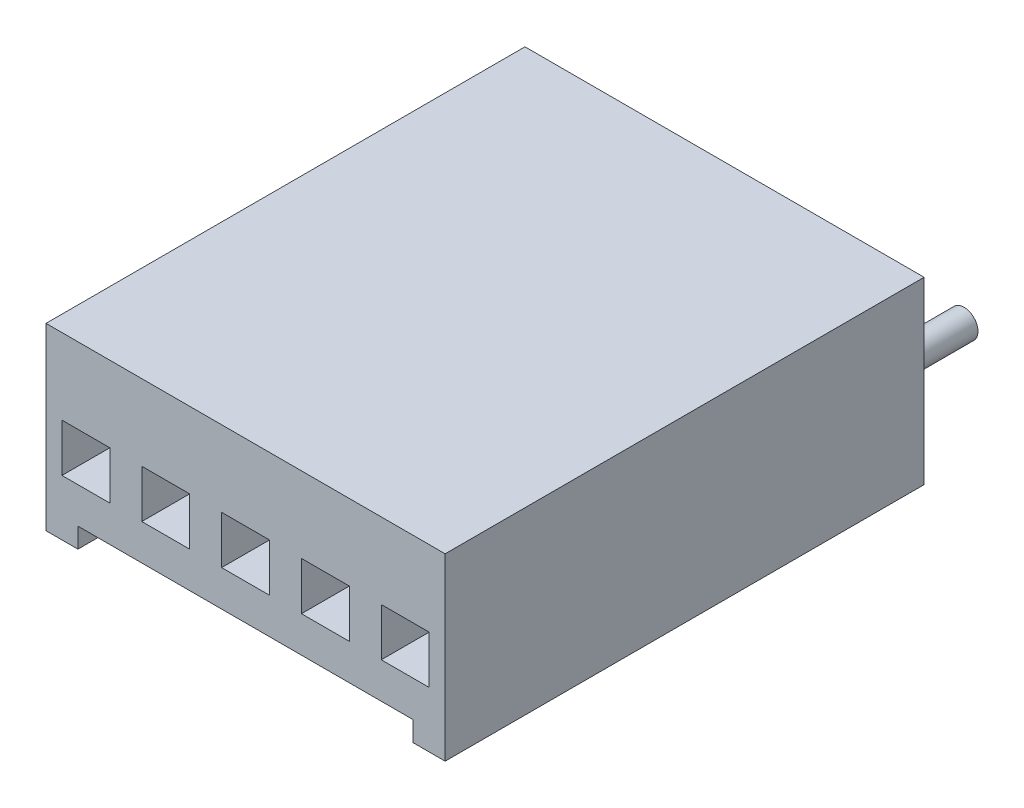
ISO-10303-21;
HEADER;
FILE_DESCRIPTION(('STEP AP214'),'2;1');
FILE_NAME('part.step','',(''),(''),'','','');
FILE_SCHEMA(('AUTOMOTIVE_DESIGN { 1 0 10303 214 1 1 1 1 }'));
ENDSEC;
DATA;
#1=APPLICATION_CONTEXT('core data for automotive mechanical design processes');
#2=APPLICATION_PROTOCOL_DEFINITION('international standard','automotive_design',2000,#1);
#3=PRODUCT_CONTEXT('',#1,'mechanical');
#4=PRODUCT('Part','Part','',(#3));
#5=PRODUCT_RELATED_PRODUCT_CATEGORY('part','',(#4));
#6=PRODUCT_DEFINITION_FORMATION('','',#4);
#7=PRODUCT_DEFINITION_CONTEXT('part definition',#1,'design');
#8=PRODUCT_DEFINITION('design','',#6,#7);
#9=PRODUCT_DEFINITION_SHAPE('','',#8);
#10=(LENGTH_UNIT() NAMED_UNIT(*) SI_UNIT(.MILLI.,.METRE.));
#11=(NAMED_UNIT(*) PLANE_ANGLE_UNIT() SI_UNIT($,.RADIAN.));
#12=(NAMED_UNIT(*) SI_UNIT($,.STERADIAN.) SOLID_ANGLE_UNIT());
#13=UNCERTAINTY_MEASURE_WITH_UNIT(LENGTH_MEASURE(1.E-05),#10,'distance_accuracy_value','');
#14=(GEOMETRIC_REPRESENTATION_CONTEXT(3) GLOBAL_UNCERTAINTY_ASSIGNED_CONTEXT((#13)) GLOBAL_UNIT_ASSIGNED_CONTEXT((#10,
#11,#12)) REPRESENTATION_CONTEXT('',''));
#15=CARTESIAN_POINT('',(0.,0.,0.));
#16=DIRECTION('',(0.,0.,1.));
#17=DIRECTION('',(1.,0.,0.));
#18=AXIS2_PLACEMENT_3D('',#15,#16,#17);
#19=CARTESIAN_POINT('',(-1.27,-1.905,15.24));
#20=DIRECTION('',(0.,1.,0.));
#21=DIRECTION('',(0.,0.,1.));
#22=AXIS2_PLACEMENT_3D('',#19,#20,#21);
#23=PLANE('',#22);
#24=DIRECTION('',(0.,0.,-1.));
#25=VECTOR('',#24,1.);
#26=CARTESIAN_POINT('',(10.414,-1.905,15.24));
#27=LINE('',#26,#25);
#28=CARTESIAN_POINT('',(10.414,-1.905,15.24));
#29=VERTEX_POINT('',#28);
#30=CARTESIAN_POINT('',(10.414,-1.905,2.54));
#31=VERTEX_POINT('',#30);
#32=EDGE_CURVE('E402',#29,#31,#27,.T.);
#33=ORIENTED_EDGE('',*,*,#32,.F.);
#34=DIRECTION('',(1.,0.,0.));
#35=VECTOR('',#34,1.);
#36=CARTESIAN_POINT('',(-1.27,-1.905,15.24));
#37=LINE('',#36,#35);
#38=CARTESIAN_POINT('',(-0.253999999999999,-1.905,15.24));
#39=VERTEX_POINT('',#38);
#40=EDGE_CURVE('E450',#39,#29,#37,.T.);
#41=ORIENTED_EDGE('',*,*,#40,.F.);
#42=DIRECTION('',(0.,0.,1.));
#43=VECTOR('',#42,1.);
#44=CARTESIAN_POINT('',(-0.254,-1.905,15.24));
#45=LINE('',#44,#43);
#46=CARTESIAN_POINT('',(-0.253999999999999,-1.905,2.54));
#47=VERTEX_POINT('',#46);
#48=EDGE_CURVE('E419',#47,#39,#45,.T.);
#49=ORIENTED_EDGE('',*,*,#48,.F.);
#50=DIRECTION('',(1.,0.,0.));
#51=VECTOR('',#50,1.);
#52=CARTESIAN_POINT('',(-1.27,-1.905,2.54));
#53=LINE('',#52,#51);
#54=CARTESIAN_POINT('',(0.,-1.905,2.54));
#55=VERTEX_POINT('',#54);
#56=EDGE_CURVE('E451',#47,#55,#53,.T.);
#57=ORIENTED_EDGE('',*,*,#56,.T.);
#58=DIRECTION('',(0.,0.,-1.));
#59=VECTOR('',#58,1.);
#60=CARTESIAN_POINT('',(0.,-1.905,10.16));
#61=LINE('',#60,#59);
#62=CARTESIAN_POINT('',(0.,-1.905,10.16));
#63=VERTEX_POINT('',#62);
#64=EDGE_CURVE('E474',#63,#55,#61,.T.);
#65=ORIENTED_EDGE('',*,*,#64,.F.);
#66=DIRECTION('',(-1.,0.,0.));
#67=VECTOR('',#66,1.);
#68=CARTESIAN_POINT('',(0.,-1.905,10.16));
#69=LINE('',#68,#67);
#70=CARTESIAN_POINT('',(10.16,-1.905,10.16));
#71=VERTEX_POINT('',#70);
#72=EDGE_CURVE('E471',#71,#63,#69,.T.);
#73=ORIENTED_EDGE('',*,*,#72,.F.);
#74=DIRECTION('',(0.,0.,-1.));
#75=VECTOR('',#74,1.);
#76=CARTESIAN_POINT('',(10.16,-1.905,10.16));
#77=LINE('',#76,#75);
#78=CARTESIAN_POINT('',(10.16,-1.905,2.54));
#79=VERTEX_POINT('',#78);
#80=EDGE_CURVE('E600',#71,#79,#77,.T.);
#81=ORIENTED_EDGE('',*,*,#80,.T.);
#82=EDGE_CURVE('E446',#79,#31,#53,.T.);
#83=ORIENTED_EDGE('',*,*,#82,.T.);
#84=EDGE_LOOP('',(#33,#41,#49,#57,#65,#73,#81,#83));
#85=FACE_BOUND('',#84,.T.);
#86=ADVANCED_FACE('F33',(#85),#23,.F.);
#87=CARTESIAN_POINT('',(-1.27,-2.54,2.54));
#88=DIRECTION('',(0.,0.,1.));
#89=DIRECTION('',(1.,0.,0.));
#90=AXIS2_PLACEMENT_3D('',#87,#88,#89);
#91=PLANE('',#90);
#92=DIRECTION('',(1.,0.,0.));
#93=VECTOR('',#92,1.);
#94=CARTESIAN_POINT('',(-1.27,-2.54,2.54));
#95=LINE('',#94,#93);
#96=CARTESIAN_POINT('',(10.16,-2.54,2.54));
#97=VERTEX_POINT('',#96);
#98=CARTESIAN_POINT('',(10.414,-2.54,2.54));
#99=VERTEX_POINT('',#98);
#100=EDGE_CURVE('E587',#97,#99,#95,.T.);
#101=ORIENTED_EDGE('',*,*,#100,.T.);
#102=DIRECTION('',(0.,1.,0.));
#103=VECTOR('',#102,1.);
#104=CARTESIAN_POINT('',(10.414,-2.54,2.54));
#105=LINE('',#104,#103);
#106=EDGE_CURVE('E416',#99,#31,#105,.T.);
#107=ORIENTED_EDGE('',*,*,#106,.T.);
#108=ORIENTED_EDGE('',*,*,#82,.F.);
#109=DIRECTION('',(0.,1.,0.));
#110=VECTOR('',#109,1.);
#111=CARTESIAN_POINT('',(10.16,-2.54,2.54));
#112=LINE('',#111,#110);
#113=EDGE_CURVE('E466',#97,#79,#112,.T.);
#114=ORIENTED_EDGE('',*,*,#113,.F.);
#115=EDGE_LOOP('',(#101,#107,#108,#114));
#116=FACE_BOUND('',#115,.T.);
#117=ADVANCED_FACE('F534',(#116),#91,.T.);
#118=ORIENTED_EDGE('',*,*,#56,.F.);
#119=DIRECTION('',(0.,1.,0.));
#120=VECTOR('',#119,1.);
#121=CARTESIAN_POINT('',(-0.253999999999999,-2.54,2.54));
#122=LINE('',#121,#120);
#123=CARTESIAN_POINT('',(-0.253999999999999,-2.54,2.54));
#124=VERTEX_POINT('',#123);
#125=EDGE_CURVE('E429',#124,#47,#122,.T.);
#126=ORIENTED_EDGE('',*,*,#125,.F.);
#127=CARTESIAN_POINT('',(0.,-2.54,2.54));
#128=VERTEX_POINT('',#127);
#129=EDGE_CURVE('E37',#124,#128,#95,.T.);
#130=ORIENTED_EDGE('',*,*,#129,.T.);
#131=DIRECTION('',(0.,-1.,0.));
#132=VECTOR('',#131,1.);
#133=CARTESIAN_POINT('',(0.,-2.54,2.54));
#134=LINE('',#133,#132);
#135=EDGE_CURVE('E460',#55,#128,#134,.T.);
#136=ORIENTED_EDGE('',*,*,#135,.F.);
#137=EDGE_LOOP('',(#118,#126,#130,#136));
#138=FACE_BOUND('',#137,.T.);
#139=ADVANCED_FACE('F502',(#138),#91,.T.);
#140=CARTESIAN_POINT('',(-1.27,-2.54,0.));
#141=DIRECTION('',(0.,0.,1.));
#142=DIRECTION('',(1.,0.,0.));
#143=AXIS2_PLACEMENT_3D('',#140,#141,#142);
#144=PLANE('',#143);
#145=CARTESIAN_POINT('',(7.62,0.,0.));
#146=DIRECTION('',(0.,0.,1.));
#147=DIRECTION('',(1.,0.,0.));
#148=AXIS2_PLACEMENT_3D('',#145,#146,#147);
#149=CIRCLE('',#148,0.4445);
#150=CARTESIAN_POINT('',(8.0645,0.,0.));
#151=VERTEX_POINT('',#150);
#152=EDGE_CURVE('E43',#151,#151,#149,.F.);
#153=ORIENTED_EDGE('',*,*,#152,.F.);
#154=EDGE_LOOP('',(#153));
#155=FACE_BOUND('',#154,.T.);
#156=CARTESIAN_POINT('',(2.54,0.,0.));
#157=DIRECTION('',(0.,0.,1.));
#158=DIRECTION('',(1.,0.,0.));
#159=AXIS2_PLACEMENT_3D('',#156,#157,#158);
#160=CIRCLE('',#159,0.4445);
#161=CARTESIAN_POINT('',(2.9845,0.,0.));
#162=VERTEX_POINT('',#161);
#163=EDGE_CURVE('E487',#162,#162,#160,.F.);
#164=ORIENTED_EDGE('',*,*,#163,.F.);
#165=EDGE_LOOP('',(#164));
#166=FACE_BOUND('',#165,.T.);
#167=DIRECTION('',(0.,-1.,0.));
#168=VECTOR('',#167,1.);
#169=CARTESIAN_POINT('',(-1.27,3.17499999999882,0.));
#170=LINE('',#169,#168);
#171=CARTESIAN_POINT('',(-1.27,3.17499999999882,0.));
#172=VERTEX_POINT('',#171);
#173=CARTESIAN_POINT('',(-1.27,-2.54,0.));
#174=VERTEX_POINT('',#173);
#175=EDGE_CURVE('E510',#172,#174,#170,.T.);
#176=ORIENTED_EDGE('',*,*,#175,.F.);
#177=DIRECTION('',(-1.,0.,0.));
#178=VECTOR('',#177,1.);
#179=CARTESIAN_POINT('',(-1.27,3.17499999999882,0.));
#180=LINE('',#179,#178);
#181=CARTESIAN_POINT('',(11.43,3.17499999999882,0.));
#182=VERTEX_POINT('',#181);
#183=EDGE_CURVE('E585',#182,#172,#180,.T.);
#184=ORIENTED_EDGE('',*,*,#183,.F.);
#185=DIRECTION('',(0.,1.,0.));
#186=VECTOR('',#185,1.);
#187=CARTESIAN_POINT('',(11.43,3.17499999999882,0.));
#188=LINE('',#187,#186);
#189=CARTESIAN_POINT('',(11.43,-2.54,0.));
#190=VERTEX_POINT('',#189);
#191=EDGE_CURVE('E579',#190,#182,#188,.T.);
#192=ORIENTED_EDGE('',*,*,#191,.F.);
#193=DIRECTION('',(1.,0.,0.));
#194=VECTOR('',#193,1.);
#195=CARTESIAN_POINT('',(-1.27,-2.54,0.));
#196=LINE('',#195,#194);
#197=EDGE_CURVE('E574',#174,#190,#196,.T.);
#198=ORIENTED_EDGE('',*,*,#197,.F.);
#199=EDGE_LOOP('',(#176,#184,#192,#198));
#200=FACE_BOUND('',#199,.T.);
#201=CARTESIAN_POINT('',(0.,0.,0.));
#202=DIRECTION('',(0.,0.,1.));
#203=DIRECTION('',(1.,0.,0.));
#204=AXIS2_PLACEMENT_3D('',#201,#202,#203);
#205=CIRCLE('',#204,0.4445);
#206=CARTESIAN_POINT('',(0.4445,0.,0.));
#207=VERTEX_POINT('',#206);
#208=EDGE_CURVE('E484',#207,#207,#205,.F.);
#209=ORIENTED_EDGE('',*,*,#208,.F.);
#210=EDGE_LOOP('',(#209));
#211=FACE_BOUND('',#210,.T.);
#212=CARTESIAN_POINT('',(5.08,0.,0.));
#213=DIRECTION('',(0.,0.,1.));
#214=DIRECTION('',(1.,0.,0.));
#215=AXIS2_PLACEMENT_3D('',#212,#213,#214);
#216=CIRCLE('',#215,0.4445);
#217=CARTESIAN_POINT('',(5.5245,0.,0.));
#218=VERTEX_POINT('',#217);
#219=EDGE_CURVE('E491',#218,#218,#216,.F.);
#220=ORIENTED_EDGE('',*,*,#219,.F.);
#221=EDGE_LOOP('',(#220));
#222=FACE_BOUND('',#221,.T.);
#223=CARTESIAN_POINT('',(10.16,0.,0.));
#224=DIRECTION('',(0.,0.,1.));
#225=DIRECTION('',(1.,0.,0.));
#226=AXIS2_PLACEMENT_3D('',#223,#224,#225);
#227=CIRCLE('',#226,0.4445);
#228=CARTESIAN_POINT('',(10.6045,0.,0.));
#229=VERTEX_POINT('',#228);
#230=EDGE_CURVE('E11',#229,#229,#227,.F.);
#231=ORIENTED_EDGE('',*,*,#230,.F.);
#232=EDGE_LOOP('',(#231));
#233=FACE_BOUND('',#232,.T.);
#234=ADVANCED_FACE('F499',(#155,#166,#200,#211,#222,#233),#144,.F.);
#235=CARTESIAN_POINT('',(-1.27,3.17499999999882,2.54));
#236=DIRECTION('',(1.,0.,0.));
#237=DIRECTION('',(0.,1.,0.));
#238=AXIS2_PLACEMENT_3D('',#235,#236,#237);
#239=PLANE('',#238);
#240=DIRECTION('',(0.,0.,-1.));
#241=VECTOR('',#240,1.);
#242=CARTESIAN_POINT('',(-1.27,-2.54,2.54));
#243=LINE('',#242,#241);
#244=CARTESIAN_POINT('',(-1.27,-2.54,15.24));
#245=VERTEX_POINT('',#244);
#246=EDGE_CURVE('E488',#245,#174,#243,.T.);
#247=ORIENTED_EDGE('',*,*,#246,.F.);
#248=DIRECTION('',(0.,-1.,0.));
#249=VECTOR('',#248,1.);
#250=CARTESIAN_POINT('',(-1.27,3.17499999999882,15.24));
#251=LINE('',#250,#249);
#252=CARTESIAN_POINT('',(-1.27,3.17499999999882,15.24));
#253=VERTEX_POINT('',#252);
#254=EDGE_CURVE('E447',#253,#245,#251,.T.);
#255=ORIENTED_EDGE('',*,*,#254,.F.);
#256=DIRECTION('',(0.,0.,-1.));
#257=VECTOR('',#256,1.);
#258=CARTESIAN_POINT('',(-1.27,3.17499999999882,2.54));
#259=LINE('',#258,#257);
#260=EDGE_CURVE('E591',#253,#172,#259,.T.);
#261=ORIENTED_EDGE('',*,*,#260,.T.);
#262=ORIENTED_EDGE('',*,*,#175,.T.);
#263=EDGE_LOOP('',(#247,#255,#261,#262));
#264=FACE_BOUND('',#263,.T.);
#265=ADVANCED_FACE('F35',(#264),#239,.F.);
#266=CARTESIAN_POINT('',(-1.27,-2.54,2.54));
#267=DIRECTION('',(0.,1.,0.));
#268=DIRECTION('',(0.,0.,1.));
#269=AXIS2_PLACEMENT_3D('',#266,#267,#268);
#270=PLANE('',#269);
#271=ORIENTED_EDGE('',*,*,#197,.T.);
#272=DIRECTION('',(0.,0.,-1.));
#273=VECTOR('',#272,1.);
#274=CARTESIAN_POINT('',(11.43,-2.54,2.54));
#275=LINE('',#274,#273);
#276=CARTESIAN_POINT('',(11.43,-2.54,15.24));
#277=VERTEX_POINT('',#276);
#278=EDGE_CURVE('E576',#277,#190,#275,.T.);
#279=ORIENTED_EDGE('',*,*,#278,.F.);
#280=DIRECTION('',(-1.,0.,0.));
#281=VECTOR('',#280,1.);
#282=CARTESIAN_POINT('',(10.414,-2.54,15.24));
#283=LINE('',#282,#281);
#284=CARTESIAN_POINT('',(10.414,-2.54,15.24));
#285=VERTEX_POINT('',#284);
#286=EDGE_CURVE('E411',#277,#285,#283,.T.);
#287=ORIENTED_EDGE('',*,*,#286,.T.);
#288=DIRECTION('',(0.,0.,-1.));
#289=VECTOR('',#288,1.);
#290=CARTESIAN_POINT('',(10.414,-2.54,15.24));
#291=LINE('',#290,#289);
#292=EDGE_CURVE('E409',#285,#99,#291,.T.);
#293=ORIENTED_EDGE('',*,*,#292,.T.);
#294=ORIENTED_EDGE('',*,*,#100,.F.);
#295=DIRECTION('',(0.,0.,-1.));
#296=VECTOR('',#295,1.);
#297=CARTESIAN_POINT('',(10.16,-2.54,10.16));
#298=LINE('',#297,#296);
#299=CARTESIAN_POINT('',(10.16,-2.54,10.16));
#300=VERTEX_POINT('',#299);
#301=EDGE_CURVE('E604',#300,#97,#298,.T.);
#302=ORIENTED_EDGE('',*,*,#301,.F.);
#303=DIRECTION('',(1.,0.,0.));
#304=VECTOR('',#303,1.);
#305=CARTESIAN_POINT('',(0.,-2.54,10.16));
#306=LINE('',#305,#304);
#307=CARTESIAN_POINT('',(0.,-2.54,10.16));
#308=VERTEX_POINT('',#307);
#309=EDGE_CURVE('E465',#308,#300,#306,.T.);
#310=ORIENTED_EDGE('',*,*,#309,.F.);
#311=DIRECTION('',(0.,0.,-1.));
#312=VECTOR('',#311,1.);
#313=CARTESIAN_POINT('',(0.,-2.54,10.16));
#314=LINE('',#313,#312);
#315=EDGE_CURVE('E602',#308,#128,#314,.T.);
#316=ORIENTED_EDGE('',*,*,#315,.T.);
#317=ORIENTED_EDGE('',*,*,#129,.F.);
#318=DIRECTION('',(0.,0.,1.));
#319=VECTOR('',#318,1.);
#320=CARTESIAN_POINT('',(-0.254,-2.54,15.24));
#321=LINE('',#320,#319);
#322=CARTESIAN_POINT('',(-0.254,-2.54,15.24));
#323=VERTEX_POINT('',#322);
#324=EDGE_CURVE('E420',#124,#323,#321,.T.);
#325=ORIENTED_EDGE('',*,*,#324,.T.);
#326=DIRECTION('',(-1.,0.,0.));
#327=VECTOR('',#326,1.);
#328=CARTESIAN_POINT('',(-1.27,-2.54,15.24));
#329=LINE('',#328,#327);
#330=EDGE_CURVE('E422',#323,#245,#329,.T.);
#331=ORIENTED_EDGE('',*,*,#330,.T.);
#332=ORIENTED_EDGE('',*,*,#246,.T.);
#333=EDGE_LOOP('',(#271,#279,#287,#293,#294,#302,#310,#316,#317,#325,#331,#332));
#334=FACE_BOUND('',#333,.T.);
#335=ADVANCED_FACE('F565',(#334),#270,.F.);
#336=CARTESIAN_POINT('',(11.43,3.17499999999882,2.54));
#337=DIRECTION('',(-1.,0.,0.));
#338=DIRECTION('',(0.,0.,1.));
#339=AXIS2_PLACEMENT_3D('',#336,#337,#338);
#340=PLANE('',#339);
#341=ORIENTED_EDGE('',*,*,#191,.T.);
#342=DIRECTION('',(0.,0.,-1.));
#343=VECTOR('',#342,1.);
#344=CARTESIAN_POINT('',(11.43,3.17499999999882,2.54));
#345=LINE('',#344,#343);
#346=CARTESIAN_POINT('',(11.43,3.17499999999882,15.24));
#347=VERTEX_POINT('',#346);
#348=EDGE_CURVE('E583',#347,#182,#345,.T.);
#349=ORIENTED_EDGE('',*,*,#348,.F.);
#350=DIRECTION('',(0.,1.,0.));
#351=VECTOR('',#350,1.);
#352=CARTESIAN_POINT('',(11.43,3.17499999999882,15.24));
#353=LINE('',#352,#351);
#354=EDGE_CURVE('E454',#277,#347,#353,.T.);
#355=ORIENTED_EDGE('',*,*,#354,.F.);
#356=ORIENTED_EDGE('',*,*,#278,.T.);
#357=EDGE_LOOP('',(#341,#349,#355,#356));
#358=FACE_BOUND('',#357,.T.);
#359=ADVANCED_FACE('F562',(#358),#340,.F.);
#360=CARTESIAN_POINT('',(-1.27,3.17499999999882,2.54));
#361=DIRECTION('',(0.,-1.,0.));
#362=DIRECTION('',(0.,0.,-1.));
#363=AXIS2_PLACEMENT_3D('',#360,#361,#362);
#364=PLANE('',#363);
#365=ORIENTED_EDGE('',*,*,#183,.T.);
#366=ORIENTED_EDGE('',*,*,#260,.F.);
#367=DIRECTION('',(-1.,0.,0.));
#368=VECTOR('',#367,1.);
#369=CARTESIAN_POINT('',(-1.27,3.17499999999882,15.24));
#370=LINE('',#369,#368);
#371=EDGE_CURVE('E457',#347,#253,#370,.T.);
#372=ORIENTED_EDGE('',*,*,#371,.F.);
#373=ORIENTED_EDGE('',*,*,#348,.T.);
#374=EDGE_LOOP('',(#365,#366,#372,#373));
#375=FACE_BOUND('',#374,.T.);
#376=ADVANCED_FACE('F557',(#375),#364,.F.);
#377=CARTESIAN_POINT('',(0.,-2.54,10.16));
#378=DIRECTION('',(1.,0.,0.));
#379=DIRECTION('',(0.,0.,-1.));
#380=AXIS2_PLACEMENT_3D('',#377,#378,#379);
#381=PLANE('',#380);
#382=ORIENTED_EDGE('',*,*,#135,.T.);
#383=ORIENTED_EDGE('',*,*,#315,.F.);
#384=DIRECTION('',(0.,-1.,0.));
#385=VECTOR('',#384,1.);
#386=CARTESIAN_POINT('',(0.,-2.54,10.16));
#387=LINE('',#386,#385);
#388=EDGE_CURVE('E462',#63,#308,#387,.T.);
#389=ORIENTED_EDGE('',*,*,#388,.F.);
#390=ORIENTED_EDGE('',*,*,#64,.T.);
#391=EDGE_LOOP('',(#382,#383,#389,#390));
#392=FACE_BOUND('',#391,.T.);
#393=ADVANCED_FACE('F554',(#392),#381,.F.);
#394=CARTESIAN_POINT('',(10.16,-2.54,10.16));
#395=DIRECTION('',(-1.,0.,0.));
#396=DIRECTION('',(0.,0.,1.));
#397=AXIS2_PLACEMENT_3D('',#394,#395,#396);
#398=PLANE('',#397);
#399=ORIENTED_EDGE('',*,*,#113,.T.);
#400=ORIENTED_EDGE('',*,*,#80,.F.);
#401=DIRECTION('',(0.,1.,0.));
#402=VECTOR('',#401,1.);
#403=CARTESIAN_POINT('',(10.16,-2.54,10.16));
#404=LINE('',#403,#402);
#405=EDGE_CURVE('E468',#300,#71,#404,.T.);
#406=ORIENTED_EDGE('',*,*,#405,.F.);
#407=ORIENTED_EDGE('',*,*,#301,.T.);
#408=EDGE_LOOP('',(#399,#400,#406,#407));
#409=FACE_BOUND('',#408,.T.);
#410=ADVANCED_FACE('F550',(#409),#398,.F.);
#411=CARTESIAN_POINT('',(0.,-1.905,10.16));
#412=DIRECTION('',(0.,0.,-1.));
#413=DIRECTION('',(-1.,0.,0.));
#414=AXIS2_PLACEMENT_3D('',#411,#412,#413);
#415=PLANE('',#414);
#416=ORIENTED_EDGE('',*,*,#388,.T.);
#417=ORIENTED_EDGE('',*,*,#309,.T.);
#418=ORIENTED_EDGE('',*,*,#405,.T.);
#419=ORIENTED_EDGE('',*,*,#72,.T.);
#420=EDGE_LOOP('',(#416,#417,#418,#419));
#421=FACE_BOUND('',#420,.T.);
#422=ADVANCED_FACE('F547',(#421),#415,.F.);
#423=CARTESIAN_POINT('',(-1.27,-1.905,15.24));
#424=DIRECTION('',(0.,0.,1.));
#425=DIRECTION('',(1.,0.,0.));
#426=AXIS2_PLACEMENT_3D('',#423,#424,#425);
#427=PLANE('',#426);
#428=DIRECTION('',(0.,-1.,0.));
#429=VECTOR('',#428,1.);
#430=CARTESIAN_POINT('',(9.398,0.762,15.24));
#431=LINE('',#430,#429);
#432=CARTESIAN_POINT('',(9.398,0.762,15.24));
#433=VERTEX_POINT('',#432);
#434=CARTESIAN_POINT('',(9.398,-0.762,15.24));
#435=VERTEX_POINT('',#434);
#436=EDGE_CURVE('E50',#433,#435,#431,.T.);
#437=ORIENTED_EDGE('',*,*,#436,.F.);
#438=DIRECTION('',(-1.,0.,0.));
#439=VECTOR('',#438,1.);
#440=CARTESIAN_POINT('',(9.398,0.762,15.24));
#441=LINE('',#440,#439);
#442=CARTESIAN_POINT('',(10.922,0.762,15.24));
#443=VERTEX_POINT('',#442);
#444=EDGE_CURVE('E264',#443,#433,#441,.T.);
#445=ORIENTED_EDGE('',*,*,#444,.F.);
#446=DIRECTION('',(0.,1.,0.));
#447=VECTOR('',#446,1.);
#448=CARTESIAN_POINT('',(10.922,0.762,15.24));
#449=LINE('',#448,#447);
#450=CARTESIAN_POINT('',(10.922,-0.762,15.24));
#451=VERTEX_POINT('',#450);
#452=EDGE_CURVE('E267',#451,#443,#449,.T.);
#453=ORIENTED_EDGE('',*,*,#452,.F.);
#454=DIRECTION('',(1.,0.,0.));
#455=VECTOR('',#454,1.);
#456=CARTESIAN_POINT('',(9.398,-0.762,15.24));
#457=LINE('',#456,#455);
#458=EDGE_CURVE('E273',#435,#451,#457,.T.);
#459=ORIENTED_EDGE('',*,*,#458,.F.);
#460=EDGE_LOOP('',(#437,#445,#453,#459));
#461=FACE_BOUND('',#460,.T.);
#462=DIRECTION('',(0.,-1.,0.));
#463=VECTOR('',#462,1.);
#464=CARTESIAN_POINT('',(6.858,0.762,15.24));
#465=LINE('',#464,#463);
#466=CARTESIAN_POINT('',(6.858,0.762,15.24));
#467=VERTEX_POINT('',#466);
#468=CARTESIAN_POINT('',(6.858,-0.762,15.24));
#469=VERTEX_POINT('',#468);
#470=EDGE_CURVE('E58',#467,#469,#465,.T.);
#471=ORIENTED_EDGE('',*,*,#470,.F.);
#472=DIRECTION('',(-1.,0.,0.));
#473=VECTOR('',#472,1.);
#474=CARTESIAN_POINT('',(6.858,0.762,15.24));
#475=LINE('',#474,#473);
#476=CARTESIAN_POINT('',(8.382,0.762,15.24));
#477=VERTEX_POINT('',#476);
#478=EDGE_CURVE('E286',#477,#467,#475,.T.);
#479=ORIENTED_EDGE('',*,*,#478,.F.);
#480=DIRECTION('',(0.,1.,0.));
#481=VECTOR('',#480,1.);
#482=CARTESIAN_POINT('',(8.382,0.762,15.24));
#483=LINE('',#482,#481);
#484=CARTESIAN_POINT('',(8.382,-0.762,15.24));
#485=VERTEX_POINT('',#484);
#486=EDGE_CURVE('E300',#485,#477,#483,.T.);
#487=ORIENTED_EDGE('',*,*,#486,.F.);
#488=DIRECTION('',(1.,0.,0.));
#489=VECTOR('',#488,1.);
#490=CARTESIAN_POINT('',(6.858,-0.762,15.24));
#491=LINE('',#490,#489);
#492=EDGE_CURVE('E297',#469,#485,#491,.T.);
#493=ORIENTED_EDGE('',*,*,#492,.F.);
#494=EDGE_LOOP('',(#471,#479,#487,#493));
#495=FACE_BOUND('',#494,.T.);
#496=DIRECTION('',(0.,-1.,0.));
#497=VECTOR('',#496,1.);
#498=CARTESIAN_POINT('',(4.318,0.762,15.24));
#499=LINE('',#498,#497);
#500=CARTESIAN_POINT('',(4.318,0.762,15.24));
#501=VERTEX_POINT('',#500);
#502=CARTESIAN_POINT('',(4.318,-0.762,15.24));
#503=VERTEX_POINT('',#502);
#504=EDGE_CURVE('E307',#501,#503,#499,.T.);
#505=ORIENTED_EDGE('',*,*,#504,.F.);
#506=DIRECTION('',(-1.,0.,0.));
#507=VECTOR('',#506,1.);
#508=CARTESIAN_POINT('',(4.318,0.762,15.24));
#509=LINE('',#508,#507);
#510=CARTESIAN_POINT('',(5.842,0.762,15.24));
#511=VERTEX_POINT('',#510);
#512=EDGE_CURVE('E317',#511,#501,#509,.T.);
#513=ORIENTED_EDGE('',*,*,#512,.F.);
#514=DIRECTION('',(0.,1.,0.));
#515=VECTOR('',#514,1.);
#516=CARTESIAN_POINT('',(5.842,0.762,15.24));
#517=LINE('',#516,#515);
#518=CARTESIAN_POINT('',(5.842,-0.762,15.24));
#519=VERTEX_POINT('',#518);
#520=EDGE_CURVE('E331',#519,#511,#517,.T.);
#521=ORIENTED_EDGE('',*,*,#520,.F.);
#522=DIRECTION('',(1.,0.,0.));
#523=VECTOR('',#522,1.);
#524=CARTESIAN_POINT('',(4.318,-0.762,15.24));
#525=LINE('',#524,#523);
#526=EDGE_CURVE('E328',#503,#519,#525,.T.);
#527=ORIENTED_EDGE('',*,*,#526,.F.);
#528=EDGE_LOOP('',(#505,#513,#521,#527));
#529=FACE_BOUND('',#528,.T.);
#530=DIRECTION('',(0.,-1.,0.));
#531=VECTOR('',#530,1.);
#532=CARTESIAN_POINT('',(1.778,0.762,15.24));
#533=LINE('',#532,#531);
#534=CARTESIAN_POINT('',(1.778,0.762,15.24));
#535=VERTEX_POINT('',#534);
#536=CARTESIAN_POINT('',(1.778,-0.762,15.24));
#537=VERTEX_POINT('',#536);
#538=EDGE_CURVE('E338',#535,#537,#533,.T.);
#539=ORIENTED_EDGE('',*,*,#538,.F.);
#540=DIRECTION('',(-1.,0.,0.));
#541=VECTOR('',#540,1.);
#542=CARTESIAN_POINT('',(1.778,0.762,15.24));
#543=LINE('',#542,#541);
#544=CARTESIAN_POINT('',(3.302,0.762,15.24));
#545=VERTEX_POINT('',#544);
#546=EDGE_CURVE('E349',#545,#535,#543,.T.);
#547=ORIENTED_EDGE('',*,*,#546,.F.);
#548=DIRECTION('',(0.,1.,0.));
#549=VECTOR('',#548,1.);
#550=CARTESIAN_POINT('',(3.302,0.762,15.24));
#551=LINE('',#550,#549);
#552=CARTESIAN_POINT('',(3.302,-0.762,15.24));
#553=VERTEX_POINT('',#552);
#554=EDGE_CURVE('E363',#553,#545,#551,.T.);
#555=ORIENTED_EDGE('',*,*,#554,.F.);
#556=DIRECTION('',(1.,0.,0.));
#557=VECTOR('',#556,1.);
#558=CARTESIAN_POINT('',(1.778,-0.762,15.24));
#559=LINE('',#558,#557);
#560=EDGE_CURVE('E360',#537,#553,#559,.T.);
#561=ORIENTED_EDGE('',*,*,#560,.F.);
#562=EDGE_LOOP('',(#539,#547,#555,#561));
#563=FACE_BOUND('',#562,.T.);
#564=DIRECTION('',(0.,-1.,0.));
#565=VECTOR('',#564,1.);
#566=CARTESIAN_POINT('',(-0.762,0.762,15.24));
#567=LINE('',#566,#565);
#568=CARTESIAN_POINT('',(-0.762,0.762,15.24));
#569=VERTEX_POINT('',#568);
#570=CARTESIAN_POINT('',(-0.762,-0.762,15.24));
#571=VERTEX_POINT('',#570);
#572=EDGE_CURVE('E370',#569,#571,#567,.T.);
#573=ORIENTED_EDGE('',*,*,#572,.F.);
#574=DIRECTION('',(-1.,0.,0.));
#575=VECTOR('',#574,1.);
#576=CARTESIAN_POINT('',(-0.762,0.762,15.24));
#577=LINE('',#576,#575);
#578=CARTESIAN_POINT('',(0.762,0.762,15.24));
#579=VERTEX_POINT('',#578);
#580=EDGE_CURVE('E381',#579,#569,#577,.T.);
#581=ORIENTED_EDGE('',*,*,#580,.F.);
#582=DIRECTION('',(0.,1.,0.));
#583=VECTOR('',#582,1.);
#584=CARTESIAN_POINT('',(0.762,0.762,15.24));
#585=LINE('',#584,#583);
#586=CARTESIAN_POINT('',(0.762,-0.762,15.24));
#587=VERTEX_POINT('',#586);
#588=EDGE_CURVE('E395',#587,#579,#585,.T.);
#589=ORIENTED_EDGE('',*,*,#588,.F.);
#590=DIRECTION('',(1.,0.,0.));
#591=VECTOR('',#590,1.);
#592=CARTESIAN_POINT('',(-0.762,-0.762,15.24));
#593=LINE('',#592,#591);
#594=EDGE_CURVE('E392',#571,#587,#593,.T.);
#595=ORIENTED_EDGE('',*,*,#594,.F.);
#596=EDGE_LOOP('',(#573,#581,#589,#595));
#597=FACE_BOUND('',#596,.T.);
#598=ORIENTED_EDGE('',*,*,#254,.T.);
#599=ORIENTED_EDGE('',*,*,#330,.F.);
#600=DIRECTION('',(0.,1.,0.));
#601=VECTOR('',#600,1.);
#602=CARTESIAN_POINT('',(-0.254,-2.54,15.24));
#603=LINE('',#602,#601);
#604=EDGE_CURVE('E425',#323,#39,#603,.T.);
#605=ORIENTED_EDGE('',*,*,#604,.T.);
#606=ORIENTED_EDGE('',*,*,#40,.T.);
#607=DIRECTION('',(0.,1.,0.));
#608=VECTOR('',#607,1.);
#609=CARTESIAN_POINT('',(10.414,-2.54,15.24));
#610=LINE('',#609,#608);
#611=EDGE_CURVE('E413',#285,#29,#610,.T.);
#612=ORIENTED_EDGE('',*,*,#611,.F.);
#613=ORIENTED_EDGE('',*,*,#286,.F.);
#614=ORIENTED_EDGE('',*,*,#354,.T.);
#615=ORIENTED_EDGE('',*,*,#371,.T.);
#616=EDGE_LOOP('',(#598,#599,#605,#606,#612,#613,#614,#615));
#617=FACE_BOUND('',#616,.T.);
#618=ADVANCED_FACE('F545',(#461,#495,#529,#563,#597,#617),#427,.T.);
#619=CARTESIAN_POINT('',(0.,0.,-2.54));
#620=DIRECTION('',(0.,0.,1.));
#621=DIRECTION('',(1.,0.,0.));
#622=AXIS2_PLACEMENT_3D('',#619,#620,#621);
#623=CYLINDRICAL_SURFACE('',#622,0.4445);
#624=CARTESIAN_POINT('',(0.,0.,-2.54));
#625=DIRECTION('',(0.,0.,-1.));
#626=DIRECTION('',(-1.,0.,0.));
#627=AXIS2_PLACEMENT_3D('',#624,#625,#626);
#628=CIRCLE('',#627,0.4445);
#629=CARTESIAN_POINT('',(-0.4445,0.,-2.54));
#630=VERTEX_POINT('',#629);
#631=EDGE_CURVE('E443',#630,#630,#628,.T.);
#632=ORIENTED_EDGE('',*,*,#631,.F.);
#633=EDGE_LOOP('',(#632));
#634=FACE_BOUND('',#633,.T.);
#635=ORIENTED_EDGE('',*,*,#208,.T.);
#636=EDGE_LOOP('',(#635));
#637=FACE_BOUND('',#636,.T.);
#638=ADVANCED_FACE('F694',(#634,#637),#623,.T.);
#639=CARTESIAN_POINT('',(0.,0.,-2.54));
#640=DIRECTION('',(0.,0.,-1.));
#641=DIRECTION('',(-1.,0.,0.));
#642=AXIS2_PLACEMENT_3D('',#639,#640,#641);
#643=PLANE('',#642);
#644=ORIENTED_EDGE('',*,*,#631,.T.);
#645=EDGE_LOOP('',(#644));
#646=FACE_BOUND('',#645,.T.);
#647=ADVANCED_FACE('F979',(#646),#643,.T.);
#648=CARTESIAN_POINT('',(2.54,0.,-2.54));
#649=DIRECTION('',(0.,0.,1.));
#650=DIRECTION('',(1.,0.,0.));
#651=AXIS2_PLACEMENT_3D('',#648,#649,#650);
#652=CYLINDRICAL_SURFACE('',#651,0.4445);
#653=CARTESIAN_POINT('',(2.54,0.,-2.54));
#654=DIRECTION('',(0.,0.,-1.));
#655=DIRECTION('',(-1.,0.,0.));
#656=AXIS2_PLACEMENT_3D('',#653,#654,#655);
#657=CIRCLE('',#656,0.4445);
#658=CARTESIAN_POINT('',(2.0955,0.,-2.54));
#659=VERTEX_POINT('',#658);
#660=EDGE_CURVE('E440',#659,#659,#657,.T.);
#661=ORIENTED_EDGE('',*,*,#660,.F.);
#662=EDGE_LOOP('',(#661));
#663=FACE_BOUND('',#662,.T.);
#664=ORIENTED_EDGE('',*,*,#163,.T.);
#665=EDGE_LOOP('',(#664));
#666=FACE_BOUND('',#665,.T.);
#667=ADVANCED_FACE('F986',(#663,#666),#652,.T.);
#668=CARTESIAN_POINT('',(2.54,0.,-2.54));
#669=DIRECTION('',(0.,0.,-1.));
#670=DIRECTION('',(-1.,0.,0.));
#671=AXIS2_PLACEMENT_3D('',#668,#669,#670);
#672=PLANE('',#671);
#673=ORIENTED_EDGE('',*,*,#660,.T.);
#674=EDGE_LOOP('',(#673));
#675=FACE_BOUND('',#674,.T.);
#676=ADVANCED_FACE('F994',(#675),#672,.T.);
#677=CARTESIAN_POINT('',(5.08,0.,-2.54));
#678=DIRECTION('',(0.,0.,1.));
#679=DIRECTION('',(1.,0.,0.));
#680=AXIS2_PLACEMENT_3D('',#677,#678,#679);
#681=CYLINDRICAL_SURFACE('',#680,0.4445);
#682=CARTESIAN_POINT('',(5.08,0.,-2.54));
#683=DIRECTION('',(0.,0.,-1.));
#684=DIRECTION('',(-1.,0.,0.));
#685=AXIS2_PLACEMENT_3D('',#682,#683,#684);
#686=CIRCLE('',#685,0.4445);
#687=CARTESIAN_POINT('',(4.6355,0.,-2.54));
#688=VERTEX_POINT('',#687);
#689=EDGE_CURVE('E437',#688,#688,#686,.T.);
#690=ORIENTED_EDGE('',*,*,#689,.F.);
#691=EDGE_LOOP('',(#690));
#692=FACE_BOUND('',#691,.T.);
#693=ORIENTED_EDGE('',*,*,#219,.T.);
#694=EDGE_LOOP('',(#693));
#695=FACE_BOUND('',#694,.T.);
#696=ADVANCED_FACE('F1002',(#692,#695),#681,.T.);
#697=CARTESIAN_POINT('',(5.08,0.,-2.54));
#698=DIRECTION('',(0.,0.,-1.));
#699=DIRECTION('',(-1.,0.,0.));
#700=AXIS2_PLACEMENT_3D('',#697,#698,#699);
#701=PLANE('',#700);
#702=ORIENTED_EDGE('',*,*,#689,.T.);
#703=EDGE_LOOP('',(#702));
#704=FACE_BOUND('',#703,.T.);
#705=ADVANCED_FACE('F1010',(#704),#701,.T.);
#706=CARTESIAN_POINT('',(7.62,0.,-2.54));
#707=DIRECTION('',(0.,0.,1.));
#708=DIRECTION('',(1.,0.,0.));
#709=AXIS2_PLACEMENT_3D('',#706,#707,#708);
#710=CYLINDRICAL_SURFACE('',#709,0.4445);
#711=CARTESIAN_POINT('',(7.62,0.,-2.54));
#712=DIRECTION('',(0.,0.,-1.));
#713=DIRECTION('',(-1.,0.,0.));
#714=AXIS2_PLACEMENT_3D('',#711,#712,#713);
#715=CIRCLE('',#714,0.4445);
#716=CARTESIAN_POINT('',(7.1755,0.,-2.54));
#717=VERTEX_POINT('',#716);
#718=EDGE_CURVE('E434',#717,#717,#715,.T.);
#719=ORIENTED_EDGE('',*,*,#718,.F.);
#720=EDGE_LOOP('',(#719));
#721=FACE_BOUND('',#720,.T.);
#722=ORIENTED_EDGE('',*,*,#152,.T.);
#723=EDGE_LOOP('',(#722));
#724=FACE_BOUND('',#723,.T.);
#725=ADVANCED_FACE('F497',(#721,#724),#710,.T.);
#726=CARTESIAN_POINT('',(7.62,0.,-2.54));
#727=DIRECTION('',(0.,0.,-1.));
#728=DIRECTION('',(-1.,0.,0.));
#729=AXIS2_PLACEMENT_3D('',#726,#727,#728);
#730=PLANE('',#729);
#731=ORIENTED_EDGE('',*,*,#718,.T.);
#732=EDGE_LOOP('',(#731));
#733=FACE_BOUND('',#732,.T.);
#734=ADVANCED_FACE('F520',(#733),#730,.T.);
#735=CARTESIAN_POINT('',(10.16,0.,-2.54));
#736=DIRECTION('',(0.,0.,1.));
#737=DIRECTION('',(1.,0.,0.));
#738=AXIS2_PLACEMENT_3D('',#735,#736,#737);
#739=CYLINDRICAL_SURFACE('',#738,0.4445);
#740=CARTESIAN_POINT('',(10.16,0.,-2.54));
#741=DIRECTION('',(0.,0.,-1.));
#742=DIRECTION('',(-1.,0.,0.));
#743=AXIS2_PLACEMENT_3D('',#740,#741,#742);
#744=CIRCLE('',#743,0.4445);
#745=CARTESIAN_POINT('',(9.7155,0.,-2.54));
#746=VERTEX_POINT('',#745);
#747=EDGE_CURVE('E431',#746,#746,#744,.T.);
#748=ORIENTED_EDGE('',*,*,#747,.F.);
#749=EDGE_LOOP('',(#748));
#750=FACE_BOUND('',#749,.T.);
#751=ORIENTED_EDGE('',*,*,#230,.T.);
#752=EDGE_LOOP('',(#751));
#753=FACE_BOUND('',#752,.T.);
#754=ADVANCED_FACE('F517',(#750,#753),#739,.T.);
#755=CARTESIAN_POINT('',(10.16,0.,-2.54));
#756=DIRECTION('',(0.,0.,-1.));
#757=DIRECTION('',(-1.,0.,0.));
#758=AXIS2_PLACEMENT_3D('',#755,#756,#757);
#759=PLANE('',#758);
#760=ORIENTED_EDGE('',*,*,#747,.T.);
#761=EDGE_LOOP('',(#760));
#762=FACE_BOUND('',#761,.T.);
#763=ADVANCED_FACE('F519',(#762),#759,.T.);
#764=CARTESIAN_POINT('',(-0.254,-2.54,15.24));
#765=DIRECTION('',(-1.,0.,0.));
#766=DIRECTION('',(0.,0.,1.));
#767=AXIS2_PLACEMENT_3D('',#764,#765,#766);
#768=PLANE('',#767);
#769=ORIENTED_EDGE('',*,*,#48,.T.);
#770=ORIENTED_EDGE('',*,*,#604,.F.);
#771=ORIENTED_EDGE('',*,*,#324,.F.);
#772=ORIENTED_EDGE('',*,*,#125,.T.);
#773=EDGE_LOOP('',(#769,#770,#771,#772));
#774=FACE_BOUND('',#773,.T.);
#775=ADVANCED_FACE('F527',(#774),#768,.F.);
#776=CARTESIAN_POINT('',(10.414,-2.54,15.24));
#777=DIRECTION('',(1.,0.,0.));
#778=DIRECTION('',(0.,0.,-1.));
#779=AXIS2_PLACEMENT_3D('',#776,#777,#778);
#780=PLANE('',#779);
#781=ORIENTED_EDGE('',*,*,#32,.T.);
#782=ORIENTED_EDGE('',*,*,#106,.F.);
#783=ORIENTED_EDGE('',*,*,#292,.F.);
#784=ORIENTED_EDGE('',*,*,#611,.T.);
#785=EDGE_LOOP('',(#781,#782,#783,#784));
#786=FACE_BOUND('',#785,.T.);
#787=ADVANCED_FACE('F628',(#786),#780,.F.);
#788=CARTESIAN_POINT('',(-0.762,0.762,2.54));
#789=DIRECTION('',(-1.,0.,0.));
#790=DIRECTION('',(0.,0.,1.));
#791=AXIS2_PLACEMENT_3D('',#788,#789,#790);
#792=PLANE('',#791);
#793=ORIENTED_EDGE('',*,*,#572,.T.);
#794=DIRECTION('',(0.,0.,1.));
#795=VECTOR('',#794,1.);
#796=CARTESIAN_POINT('',(-0.762,-0.762,2.54));
#797=LINE('',#796,#795);
#798=CARTESIAN_POINT('',(-0.762,-0.762,2.54));
#799=VERTEX_POINT('',#798);
#800=EDGE_CURVE('E390',#799,#571,#797,.T.);
#801=ORIENTED_EDGE('',*,*,#800,.F.);
#802=DIRECTION('',(0.,-1.,0.));
#803=VECTOR('',#802,1.);
#804=CARTESIAN_POINT('',(-0.762,0.762,2.54));
#805=LINE('',#804,#803);
#806=CARTESIAN_POINT('',(-0.762,0.762,2.54));
#807=VERTEX_POINT('',#806);
#808=EDGE_CURVE('E377',#807,#799,#805,.T.);
#809=ORIENTED_EDGE('',*,*,#808,.F.);
#810=DIRECTION('',(0.,0.,1.));
#811=VECTOR('',#810,1.);
#812=CARTESIAN_POINT('',(-0.762,0.762,2.54));
#813=LINE('',#812,#811);
#814=EDGE_CURVE('E400',#807,#569,#813,.T.);
#815=ORIENTED_EDGE('',*,*,#814,.T.);
#816=EDGE_LOOP('',(#793,#801,#809,#815));
#817=FACE_BOUND('',#816,.T.);
#818=ADVANCED_FACE('F684',(#817),#792,.F.);
#819=CARTESIAN_POINT('',(-0.762,0.762,2.54));
#820=DIRECTION('',(0.,1.,0.));
#821=DIRECTION('',(0.,0.,1.));
#822=AXIS2_PLACEMENT_3D('',#819,#820,#821);
#823=PLANE('',#822);
#824=ORIENTED_EDGE('',*,*,#580,.T.);
#825=ORIENTED_EDGE('',*,*,#814,.F.);
#826=DIRECTION('',(-1.,0.,0.));
#827=VECTOR('',#826,1.);
#828=CARTESIAN_POINT('',(-0.762,0.762,2.54));
#829=LINE('',#828,#827);
#830=CARTESIAN_POINT('',(0.762,0.762,2.54));
#831=VERTEX_POINT('',#830);
#832=EDGE_CURVE('E387',#831,#807,#829,.T.);
#833=ORIENTED_EDGE('',*,*,#832,.F.);
#834=DIRECTION('',(0.,0.,1.));
#835=VECTOR('',#834,1.);
#836=CARTESIAN_POINT('',(0.762,0.762,2.54));
#837=LINE('',#836,#835);
#838=EDGE_CURVE('E403',#831,#579,#837,.T.);
#839=ORIENTED_EDGE('',*,*,#838,.T.);
#840=EDGE_LOOP('',(#824,#825,#833,#839));
#841=FACE_BOUND('',#840,.T.);
#842=ADVANCED_FACE('F702',(#841),#823,.F.);
#843=CARTESIAN_POINT('',(0.762,0.762,2.54));
#844=DIRECTION('',(1.,0.,0.));
#845=DIRECTION('',(0.,1.,0.));
#846=AXIS2_PLACEMENT_3D('',#843,#844,#845);
#847=PLANE('',#846);
#848=ORIENTED_EDGE('',*,*,#588,.T.);
#849=ORIENTED_EDGE('',*,*,#838,.F.);
#850=DIRECTION('',(0.,1.,0.));
#851=VECTOR('',#850,1.);
#852=CARTESIAN_POINT('',(0.762,0.762,2.54));
#853=LINE('',#852,#851);
#854=CARTESIAN_POINT('',(0.762,-0.762,2.54));
#855=VERTEX_POINT('',#854);
#856=EDGE_CURVE('E384',#855,#831,#853,.T.);
#857=ORIENTED_EDGE('',*,*,#856,.F.);
#858=DIRECTION('',(0.,0.,1.));
#859=VECTOR('',#858,1.);
#860=CARTESIAN_POINT('',(0.762,-0.762,2.54));
#861=LINE('',#860,#859);
#862=EDGE_CURVE('E405',#855,#587,#861,.T.);
#863=ORIENTED_EDGE('',*,*,#862,.T.);
#864=EDGE_LOOP('',(#848,#849,#857,#863));
#865=FACE_BOUND('',#864,.T.);
#866=ADVANCED_FACE('F712',(#865),#847,.F.);
#867=CARTESIAN_POINT('',(-0.762,-0.762,2.54));
#868=DIRECTION('',(0.,-1.,0.));
#869=DIRECTION('',(0.,0.,-1.));
#870=AXIS2_PLACEMENT_3D('',#867,#868,#869);
#871=PLANE('',#870);
#872=ORIENTED_EDGE('',*,*,#594,.T.);
#873=ORIENTED_EDGE('',*,*,#862,.F.);
#874=DIRECTION('',(1.,0.,0.));
#875=VECTOR('',#874,1.);
#876=CARTESIAN_POINT('',(-0.762,-0.762,2.54));
#877=LINE('',#876,#875);
#878=EDGE_CURVE('E380',#799,#855,#877,.T.);
#879=ORIENTED_EDGE('',*,*,#878,.F.);
#880=ORIENTED_EDGE('',*,*,#800,.T.);
#881=EDGE_LOOP('',(#872,#873,#879,#880));
#882=FACE_BOUND('',#881,.T.);
#883=ADVANCED_FACE('F722',(#882),#871,.F.);
#884=CARTESIAN_POINT('',(-0.762,-0.762,2.54));
#885=DIRECTION('',(0.,0.,1.));
#886=DIRECTION('',(1.,0.,0.));
#887=AXIS2_PLACEMENT_3D('',#884,#885,#886);
#888=PLANE('',#887);
#889=ORIENTED_EDGE('',*,*,#808,.T.);
#890=ORIENTED_EDGE('',*,*,#878,.T.);
#891=ORIENTED_EDGE('',*,*,#856,.T.);
#892=ORIENTED_EDGE('',*,*,#832,.T.);
#893=EDGE_LOOP('',(#889,#890,#891,#892));
#894=FACE_BOUND('',#893,.T.);
#895=ADVANCED_FACE('F732',(#894),#888,.T.);
#896=CARTESIAN_POINT('',(1.778,0.762,2.54));
#897=DIRECTION('',(-1.,0.,0.));
#898=DIRECTION('',(0.,0.,1.));
#899=AXIS2_PLACEMENT_3D('',#896,#897,#898);
#900=PLANE('',#899);
#901=ORIENTED_EDGE('',*,*,#538,.T.);
#902=DIRECTION('',(0.,0.,1.));
#903=VECTOR('',#902,1.);
#904=CARTESIAN_POINT('',(1.778,-0.762,2.54));
#905=LINE('',#904,#903);
#906=CARTESIAN_POINT('',(1.778,-0.762,2.54));
#907=VERTEX_POINT('',#906);
#908=EDGE_CURVE('E358',#907,#537,#905,.T.);
#909=ORIENTED_EDGE('',*,*,#908,.F.);
#910=DIRECTION('',(0.,-1.,0.));
#911=VECTOR('',#910,1.);
#912=CARTESIAN_POINT('',(1.778,0.762,2.54));
#913=LINE('',#912,#911);
#914=CARTESIAN_POINT('',(1.778,0.762,2.54));
#915=VERTEX_POINT('',#914);
#916=EDGE_CURVE('E345',#915,#907,#913,.T.);
#917=ORIENTED_EDGE('',*,*,#916,.F.);
#918=DIRECTION('',(0.,0.,1.));
#919=VECTOR('',#918,1.);
#920=CARTESIAN_POINT('',(1.778,0.762,2.54));
#921=LINE('',#920,#919);
#922=EDGE_CURVE('E368',#915,#535,#921,.T.);
#923=ORIENTED_EDGE('',*,*,#922,.T.);
#924=EDGE_LOOP('',(#901,#909,#917,#923));
#925=FACE_BOUND('',#924,.T.);
#926=ADVANCED_FACE('F742',(#925),#900,.F.);
#927=CARTESIAN_POINT('',(1.778,0.762,2.54));
#928=DIRECTION('',(0.,1.,0.));
#929=DIRECTION('',(0.,0.,1.));
#930=AXIS2_PLACEMENT_3D('',#927,#928,#929);
#931=PLANE('',#930);
#932=ORIENTED_EDGE('',*,*,#546,.T.);
#933=ORIENTED_EDGE('',*,*,#922,.F.);
#934=DIRECTION('',(-1.,0.,0.));
#935=VECTOR('',#934,1.);
#936=CARTESIAN_POINT('',(1.778,0.762,2.54));
#937=LINE('',#936,#935);
#938=CARTESIAN_POINT('',(3.302,0.762,2.54));
#939=VERTEX_POINT('',#938);
#940=EDGE_CURVE('E355',#939,#915,#937,.T.);
#941=ORIENTED_EDGE('',*,*,#940,.F.);
#942=DIRECTION('',(0.,0.,1.));
#943=VECTOR('',#942,1.);
#944=CARTESIAN_POINT('',(3.302,0.762,2.54));
#945=LINE('',#944,#943);
#946=EDGE_CURVE('E371',#939,#545,#945,.T.);
#947=ORIENTED_EDGE('',*,*,#946,.T.);
#948=EDGE_LOOP('',(#932,#933,#941,#947));
#949=FACE_BOUND('',#948,.T.);
#950=ADVANCED_FACE('F752',(#949),#931,.F.);
#951=CARTESIAN_POINT('',(3.302,0.762,2.54));
#952=DIRECTION('',(1.,0.,0.));
#953=DIRECTION('',(0.,0.,-1.));
#954=AXIS2_PLACEMENT_3D('',#951,#952,#953);
#955=PLANE('',#954);
#956=ORIENTED_EDGE('',*,*,#554,.T.);
#957=ORIENTED_EDGE('',*,*,#946,.F.);
#958=DIRECTION('',(0.,1.,0.));
#959=VECTOR('',#958,1.);
#960=CARTESIAN_POINT('',(3.302,0.762,2.54));
#961=LINE('',#960,#959);
#962=CARTESIAN_POINT('',(3.302,-0.762,2.54));
#963=VERTEX_POINT('',#962);
#964=EDGE_CURVE('E352',#963,#939,#961,.T.);
#965=ORIENTED_EDGE('',*,*,#964,.F.);
#966=DIRECTION('',(0.,0.,1.));
#967=VECTOR('',#966,1.);
#968=CARTESIAN_POINT('',(3.302,-0.762,2.54));
#969=LINE('',#968,#967);
#970=EDGE_CURVE('E373',#963,#553,#969,.T.);
#971=ORIENTED_EDGE('',*,*,#970,.T.);
#972=EDGE_LOOP('',(#956,#957,#965,#971));
#973=FACE_BOUND('',#972,.T.);
#974=ADVANCED_FACE('F762',(#973),#955,.F.);
#975=CARTESIAN_POINT('',(1.778,-0.762,2.54));
#976=DIRECTION('',(0.,-1.,0.));
#977=DIRECTION('',(0.,0.,-1.));
#978=AXIS2_PLACEMENT_3D('',#975,#976,#977);
#979=PLANE('',#978);
#980=ORIENTED_EDGE('',*,*,#560,.T.);
#981=ORIENTED_EDGE('',*,*,#970,.F.);
#982=DIRECTION('',(1.,0.,0.));
#983=VECTOR('',#982,1.);
#984=CARTESIAN_POINT('',(1.778,-0.762,2.54));
#985=LINE('',#984,#983);
#986=EDGE_CURVE('E348',#907,#963,#985,.T.);
#987=ORIENTED_EDGE('',*,*,#986,.F.);
#988=ORIENTED_EDGE('',*,*,#908,.T.);
#989=EDGE_LOOP('',(#980,#981,#987,#988));
#990=FACE_BOUND('',#989,.T.);
#991=ADVANCED_FACE('F772',(#990),#979,.F.);
#992=CARTESIAN_POINT('',(1.778,-0.762,2.54));
#993=DIRECTION('',(0.,0.,1.));
#994=DIRECTION('',(1.,0.,0.));
#995=AXIS2_PLACEMENT_3D('',#992,#993,#994);
#996=PLANE('',#995);
#997=ORIENTED_EDGE('',*,*,#916,.T.);
#998=ORIENTED_EDGE('',*,*,#986,.T.);
#999=ORIENTED_EDGE('',*,*,#964,.T.);
#1000=ORIENTED_EDGE('',*,*,#940,.T.);
#1001=EDGE_LOOP('',(#997,#998,#999,#1000));
#1002=FACE_BOUND('',#1001,.T.);
#1003=ADVANCED_FACE('F782',(#1002),#996,.T.);
#1004=CARTESIAN_POINT('',(4.318,0.762,2.54));
#1005=DIRECTION('',(-1.,0.,0.));
#1006=DIRECTION('',(0.,0.,1.));
#1007=AXIS2_PLACEMENT_3D('',#1004,#1005,#1006);
#1008=PLANE('',#1007);
#1009=ORIENTED_EDGE('',*,*,#504,.T.);
#1010=DIRECTION('',(0.,0.,1.));
#1011=VECTOR('',#1010,1.);
#1012=CARTESIAN_POINT('',(4.318,-0.762,2.54));
#1013=LINE('',#1012,#1011);
#1014=CARTESIAN_POINT('',(4.318,-0.762,2.54));
#1015=VERTEX_POINT('',#1014);
#1016=EDGE_CURVE('E326',#1015,#503,#1013,.T.);
#1017=ORIENTED_EDGE('',*,*,#1016,.F.);
#1018=DIRECTION('',(0.,-1.,0.));
#1019=VECTOR('',#1018,1.);
#1020=CARTESIAN_POINT('',(4.318,0.762,2.54));
#1021=LINE('',#1020,#1019);
#1022=CARTESIAN_POINT('',(4.318,0.762,2.54));
#1023=VERTEX_POINT('',#1022);
#1024=EDGE_CURVE('E313',#1023,#1015,#1021,.T.);
#1025=ORIENTED_EDGE('',*,*,#1024,.F.);
#1026=DIRECTION('',(0.,0.,1.));
#1027=VECTOR('',#1026,1.);
#1028=CARTESIAN_POINT('',(4.318,0.762,2.54));
#1029=LINE('',#1028,#1027);
#1030=EDGE_CURVE('E336',#1023,#501,#1029,.T.);
#1031=ORIENTED_EDGE('',*,*,#1030,.T.);
#1032=EDGE_LOOP('',(#1009,#1017,#1025,#1031));
#1033=FACE_BOUND('',#1032,.T.);
#1034=ADVANCED_FACE('F792',(#1033),#1008,.F.);
#1035=CARTESIAN_POINT('',(4.318,0.762,2.54));
#1036=DIRECTION('',(0.,1.,0.));
#1037=DIRECTION('',(0.,0.,1.));
#1038=AXIS2_PLACEMENT_3D('',#1035,#1036,#1037);
#1039=PLANE('',#1038);
#1040=ORIENTED_EDGE('',*,*,#512,.T.);
#1041=ORIENTED_EDGE('',*,*,#1030,.F.);
#1042=DIRECTION('',(-1.,0.,0.));
#1043=VECTOR('',#1042,1.);
#1044=CARTESIAN_POINT('',(4.318,0.762,2.54));
#1045=LINE('',#1044,#1043);
#1046=CARTESIAN_POINT('',(5.842,0.762,2.54));
#1047=VERTEX_POINT('',#1046);
#1048=EDGE_CURVE('E323',#1047,#1023,#1045,.T.);
#1049=ORIENTED_EDGE('',*,*,#1048,.F.);
#1050=DIRECTION('',(0.,0.,1.));
#1051=VECTOR('',#1050,1.);
#1052=CARTESIAN_POINT('',(5.842,0.762,2.54));
#1053=LINE('',#1052,#1051);
#1054=EDGE_CURVE('E339',#1047,#511,#1053,.T.);
#1055=ORIENTED_EDGE('',*,*,#1054,.T.);
#1056=EDGE_LOOP('',(#1040,#1041,#1049,#1055));
#1057=FACE_BOUND('',#1056,.T.);
#1058=ADVANCED_FACE('F802',(#1057),#1039,.F.);
#1059=CARTESIAN_POINT('',(5.842,0.762,2.54));
#1060=DIRECTION('',(1.,0.,0.));
#1061=DIRECTION('',(0.,0.,-1.));
#1062=AXIS2_PLACEMENT_3D('',#1059,#1060,#1061);
#1063=PLANE('',#1062);
#1064=ORIENTED_EDGE('',*,*,#520,.T.);
#1065=ORIENTED_EDGE('',*,*,#1054,.F.);
#1066=DIRECTION('',(0.,1.,0.));
#1067=VECTOR('',#1066,1.);
#1068=CARTESIAN_POINT('',(5.842,0.762,2.54));
#1069=LINE('',#1068,#1067);
#1070=CARTESIAN_POINT('',(5.842,-0.762,2.54));
#1071=VERTEX_POINT('',#1070);
#1072=EDGE_CURVE('E320',#1071,#1047,#1069,.T.);
#1073=ORIENTED_EDGE('',*,*,#1072,.F.);
#1074=DIRECTION('',(0.,0.,1.));
#1075=VECTOR('',#1074,1.);
#1076=CARTESIAN_POINT('',(5.842,-0.762,2.54));
#1077=LINE('',#1076,#1075);
#1078=EDGE_CURVE('E341',#1071,#519,#1077,.T.);
#1079=ORIENTED_EDGE('',*,*,#1078,.T.);
#1080=EDGE_LOOP('',(#1064,#1065,#1073,#1079));
#1081=FACE_BOUND('',#1080,.T.);
#1082=ADVANCED_FACE('F812',(#1081),#1063,.F.);
#1083=CARTESIAN_POINT('',(4.318,-0.762,2.54));
#1084=DIRECTION('',(0.,-1.,0.));
#1085=DIRECTION('',(0.,0.,-1.));
#1086=AXIS2_PLACEMENT_3D('',#1083,#1084,#1085);
#1087=PLANE('',#1086);
#1088=ORIENTED_EDGE('',*,*,#526,.T.);
#1089=ORIENTED_EDGE('',*,*,#1078,.F.);
#1090=DIRECTION('',(1.,0.,0.));
#1091=VECTOR('',#1090,1.);
#1092=CARTESIAN_POINT('',(4.318,-0.762,2.54));
#1093=LINE('',#1092,#1091);
#1094=EDGE_CURVE('E316',#1015,#1071,#1093,.T.);
#1095=ORIENTED_EDGE('',*,*,#1094,.F.);
#1096=ORIENTED_EDGE('',*,*,#1016,.T.);
#1097=EDGE_LOOP('',(#1088,#1089,#1095,#1096));
#1098=FACE_BOUND('',#1097,.T.);
#1099=ADVANCED_FACE('F822',(#1098),#1087,.F.);
#1100=CARTESIAN_POINT('',(4.318,-0.762,2.54));
#1101=DIRECTION('',(0.,0.,1.));
#1102=DIRECTION('',(1.,0.,0.));
#1103=AXIS2_PLACEMENT_3D('',#1100,#1101,#1102);
#1104=PLANE('',#1103);
#1105=ORIENTED_EDGE('',*,*,#1024,.T.);
#1106=ORIENTED_EDGE('',*,*,#1094,.T.);
#1107=ORIENTED_EDGE('',*,*,#1072,.T.);
#1108=ORIENTED_EDGE('',*,*,#1048,.T.);
#1109=EDGE_LOOP('',(#1105,#1106,#1107,#1108));
#1110=FACE_BOUND('',#1109,.T.);
#1111=ADVANCED_FACE('F832',(#1110),#1104,.T.);
#1112=CARTESIAN_POINT('',(6.858,0.762,2.54));
#1113=DIRECTION('',(-1.,0.,0.));
#1114=DIRECTION('',(0.,0.,1.));
#1115=AXIS2_PLACEMENT_3D('',#1112,#1113,#1114);
#1116=PLANE('',#1115);
#1117=ORIENTED_EDGE('',*,*,#470,.T.);
#1118=DIRECTION('',(0.,0.,1.));
#1119=VECTOR('',#1118,1.);
#1120=CARTESIAN_POINT('',(6.858,-0.762,2.54));
#1121=LINE('',#1120,#1119);
#1122=CARTESIAN_POINT('',(6.858,-0.762,2.54));
#1123=VERTEX_POINT('',#1122);
#1124=EDGE_CURVE('E295',#1123,#469,#1121,.T.);
#1125=ORIENTED_EDGE('',*,*,#1124,.F.);
#1126=DIRECTION('',(0.,-1.,0.));
#1127=VECTOR('',#1126,1.);
#1128=CARTESIAN_POINT('',(6.858,0.762,2.54));
#1129=LINE('',#1128,#1127);
#1130=CARTESIAN_POINT('',(6.858,0.762,2.54));
#1131=VERTEX_POINT('',#1130);
#1132=EDGE_CURVE('E282',#1131,#1123,#1129,.T.);
#1133=ORIENTED_EDGE('',*,*,#1132,.F.);
#1134=DIRECTION('',(0.,0.,1.));
#1135=VECTOR('',#1134,1.);
#1136=CARTESIAN_POINT('',(6.858,0.762,2.54));
#1137=LINE('',#1136,#1135);
#1138=EDGE_CURVE('E305',#1131,#467,#1137,.T.);
#1139=ORIENTED_EDGE('',*,*,#1138,.T.);
#1140=EDGE_LOOP('',(#1117,#1125,#1133,#1139));
#1141=FACE_BOUND('',#1140,.T.);
#1142=ADVANCED_FACE('F842',(#1141),#1116,.F.);
#1143=CARTESIAN_POINT('',(6.858,0.762,2.54));
#1144=DIRECTION('',(0.,1.,0.));
#1145=DIRECTION('',(0.,0.,1.));
#1146=AXIS2_PLACEMENT_3D('',#1143,#1144,#1145);
#1147=PLANE('',#1146);
#1148=ORIENTED_EDGE('',*,*,#478,.T.);
#1149=ORIENTED_EDGE('',*,*,#1138,.F.);
#1150=DIRECTION('',(-1.,0.,0.));
#1151=VECTOR('',#1150,1.);
#1152=CARTESIAN_POINT('',(6.858,0.762,2.54));
#1153=LINE('',#1152,#1151);
#1154=CARTESIAN_POINT('',(8.382,0.762,2.54));
#1155=VERTEX_POINT('',#1154);
#1156=EDGE_CURVE('E292',#1155,#1131,#1153,.T.);
#1157=ORIENTED_EDGE('',*,*,#1156,.F.);
#1158=DIRECTION('',(0.,0.,1.));
#1159=VECTOR('',#1158,1.);
#1160=CARTESIAN_POINT('',(8.382,0.762,2.54));
#1161=LINE('',#1160,#1159);
#1162=EDGE_CURVE('E308',#1155,#477,#1161,.T.);
#1163=ORIENTED_EDGE('',*,*,#1162,.T.);
#1164=EDGE_LOOP('',(#1148,#1149,#1157,#1163));
#1165=FACE_BOUND('',#1164,.T.);
#1166=ADVANCED_FACE('F852',(#1165),#1147,.F.);
#1167=CARTESIAN_POINT('',(8.382,0.762,2.54));
#1168=DIRECTION('',(1.,0.,0.));
#1169=DIRECTION('',(0.,0.,-1.));
#1170=AXIS2_PLACEMENT_3D('',#1167,#1168,#1169);
#1171=PLANE('',#1170);
#1172=ORIENTED_EDGE('',*,*,#486,.T.);
#1173=ORIENTED_EDGE('',*,*,#1162,.F.);
#1174=DIRECTION('',(0.,1.,0.));
#1175=VECTOR('',#1174,1.);
#1176=CARTESIAN_POINT('',(8.382,0.762,2.54));
#1177=LINE('',#1176,#1175);
#1178=CARTESIAN_POINT('',(8.382,-0.762,2.54));
#1179=VERTEX_POINT('',#1178);
#1180=EDGE_CURVE('E289',#1179,#1155,#1177,.T.);
#1181=ORIENTED_EDGE('',*,*,#1180,.F.);
#1182=DIRECTION('',(0.,0.,1.));
#1183=VECTOR('',#1182,1.);
#1184=CARTESIAN_POINT('',(8.382,-0.762,2.54));
#1185=LINE('',#1184,#1183);
#1186=EDGE_CURVE('E310',#1179,#485,#1185,.T.);
#1187=ORIENTED_EDGE('',*,*,#1186,.T.);
#1188=EDGE_LOOP('',(#1172,#1173,#1181,#1187));
#1189=FACE_BOUND('',#1188,.T.);
#1190=ADVANCED_FACE('F861',(#1189),#1171,.F.);
#1191=CARTESIAN_POINT('',(6.858,-0.762,2.54));
#1192=DIRECTION('',(0.,-1.,0.));
#1193=DIRECTION('',(0.,0.,-1.));
#1194=AXIS2_PLACEMENT_3D('',#1191,#1192,#1193);
#1195=PLANE('',#1194);
#1196=ORIENTED_EDGE('',*,*,#492,.T.);
#1197=ORIENTED_EDGE('',*,*,#1186,.F.);
#1198=DIRECTION('',(1.,0.,0.));
#1199=VECTOR('',#1198,1.);
#1200=CARTESIAN_POINT('',(6.858,-0.762,2.54));
#1201=LINE('',#1200,#1199);
#1202=EDGE_CURVE('E285',#1123,#1179,#1201,.T.);
#1203=ORIENTED_EDGE('',*,*,#1202,.F.);
#1204=ORIENTED_EDGE('',*,*,#1124,.T.);
#1205=EDGE_LOOP('',(#1196,#1197,#1203,#1204));
#1206=FACE_BOUND('',#1205,.T.);
#1207=ADVANCED_FACE('F871',(#1206),#1195,.F.);
#1208=CARTESIAN_POINT('',(6.858,-0.762,2.54));
#1209=DIRECTION('',(0.,0.,1.));
#1210=DIRECTION('',(1.,0.,0.));
#1211=AXIS2_PLACEMENT_3D('',#1208,#1209,#1210);
#1212=PLANE('',#1211);
#1213=ORIENTED_EDGE('',*,*,#1132,.T.);
#1214=ORIENTED_EDGE('',*,*,#1202,.T.);
#1215=ORIENTED_EDGE('',*,*,#1180,.T.);
#1216=ORIENTED_EDGE('',*,*,#1156,.T.);
#1217=EDGE_LOOP('',(#1213,#1214,#1215,#1216));
#1218=FACE_BOUND('',#1217,.T.);
#1219=ADVANCED_FACE('F881',(#1218),#1212,.T.);
#1220=CARTESIAN_POINT('',(9.398,0.762,2.54));
#1221=DIRECTION('',(-1.,0.,0.));
#1222=DIRECTION('',(0.,0.,1.));
#1223=AXIS2_PLACEMENT_3D('',#1220,#1221,#1222);
#1224=PLANE('',#1223);
#1225=ORIENTED_EDGE('',*,*,#436,.T.);
#1226=DIRECTION('',(0.,0.,1.));
#1227=VECTOR('',#1226,1.);
#1228=CARTESIAN_POINT('',(9.398,-0.762,2.54));
#1229=LINE('',#1228,#1227);
#1230=CARTESIAN_POINT('',(9.398,-0.762,2.54));
#1231=VERTEX_POINT('',#1230);
#1232=EDGE_CURVE('E242',#1231,#435,#1229,.T.);
#1233=ORIENTED_EDGE('',*,*,#1232,.F.);
#1234=DIRECTION('',(0.,-1.,0.));
#1235=VECTOR('',#1234,1.);
#1236=CARTESIAN_POINT('',(9.398,0.762,2.54));
#1237=LINE('',#1236,#1235);
#1238=CARTESIAN_POINT('',(9.398,0.762,2.54));
#1239=VERTEX_POINT('',#1238);
#1240=EDGE_CURVE('E246',#1239,#1231,#1237,.T.);
#1241=ORIENTED_EDGE('',*,*,#1240,.F.);
#1242=DIRECTION('',(0.,0.,1.));
#1243=VECTOR('',#1242,1.);
#1244=CARTESIAN_POINT('',(9.398,0.762,2.54));
#1245=LINE('',#1244,#1243);
#1246=EDGE_CURVE('E277',#1239,#433,#1245,.T.);
#1247=ORIENTED_EDGE('',*,*,#1246,.T.);
#1248=EDGE_LOOP('',(#1225,#1233,#1241,#1247));
#1249=FACE_BOUND('',#1248,.T.);
#1250=ADVANCED_FACE('F244',(#1249),#1224,.F.);
#1251=CARTESIAN_POINT('',(9.398,0.762,2.54));
#1252=DIRECTION('',(0.,1.,0.));
#1253=DIRECTION('',(0.,0.,1.));
#1254=AXIS2_PLACEMENT_3D('',#1251,#1252,#1253);
#1255=PLANE('',#1254);
#1256=ORIENTED_EDGE('',*,*,#444,.T.);
#1257=ORIENTED_EDGE('',*,*,#1246,.F.);
#1258=DIRECTION('',(-1.,0.,0.));
#1259=VECTOR('',#1258,1.);
#1260=CARTESIAN_POINT('',(9.398,0.762,2.54));
#1261=LINE('',#1260,#1259);
#1262=CARTESIAN_POINT('',(10.922,0.762,2.54));
#1263=VERTEX_POINT('',#1262);
#1264=EDGE_CURVE('E252',#1263,#1239,#1261,.T.);
#1265=ORIENTED_EDGE('',*,*,#1264,.F.);
#1266=DIRECTION('',(0.,0.,1.));
#1267=VECTOR('',#1266,1.);
#1268=CARTESIAN_POINT('',(10.922,0.762,2.54));
#1269=LINE('',#1268,#1267);
#1270=EDGE_CURVE('E279',#1263,#443,#1269,.T.);
#1271=ORIENTED_EDGE('',*,*,#1270,.T.);
#1272=EDGE_LOOP('',(#1256,#1257,#1265,#1271));
#1273=FACE_BOUND('',#1272,.T.);
#1274=ADVANCED_FACE('F900',(#1273),#1255,.F.);
#1275=CARTESIAN_POINT('',(10.922,0.762,2.54));
#1276=DIRECTION('',(1.,0.,0.));
#1277=DIRECTION('',(0.,0.,-1.));
#1278=AXIS2_PLACEMENT_3D('',#1275,#1276,#1277);
#1279=PLANE('',#1278);
#1280=ORIENTED_EDGE('',*,*,#452,.T.);
#1281=ORIENTED_EDGE('',*,*,#1270,.F.);
#1282=DIRECTION('',(0.,1.,0.));
#1283=VECTOR('',#1282,1.);
#1284=CARTESIAN_POINT('',(10.922,0.762,2.54));
#1285=LINE('',#1284,#1283);
#1286=CARTESIAN_POINT('',(10.922,-0.762,2.54));
#1287=VERTEX_POINT('',#1286);
#1288=EDGE_CURVE('E260',#1287,#1263,#1285,.T.);
#1289=ORIENTED_EDGE('',*,*,#1288,.F.);
#1290=DIRECTION('',(0.,0.,1.));
#1291=VECTOR('',#1290,1.);
#1292=CARTESIAN_POINT('',(10.922,-0.762,2.54));
#1293=LINE('',#1292,#1291);
#1294=EDGE_CURVE('E251',#1287,#451,#1293,.T.);
#1295=ORIENTED_EDGE('',*,*,#1294,.T.);
#1296=EDGE_LOOP('',(#1280,#1281,#1289,#1295));
#1297=FACE_BOUND('',#1296,.T.);
#1298=ADVANCED_FACE('F909',(#1297),#1279,.F.);
#1299=CARTESIAN_POINT('',(9.398,-0.762,2.54));
#1300=DIRECTION('',(0.,-1.,0.));
#1301=DIRECTION('',(0.,0.,-1.));
#1302=AXIS2_PLACEMENT_3D('',#1299,#1300,#1301);
#1303=PLANE('',#1302);
#1304=ORIENTED_EDGE('',*,*,#458,.T.);
#1305=ORIENTED_EDGE('',*,*,#1294,.F.);
#1306=DIRECTION('',(1.,0.,0.));
#1307=VECTOR('',#1306,1.);
#1308=CARTESIAN_POINT('',(9.398,-0.762,2.54));
#1309=LINE('',#1308,#1307);
#1310=EDGE_CURVE('E255',#1231,#1287,#1309,.T.);
#1311=ORIENTED_EDGE('',*,*,#1310,.F.);
#1312=ORIENTED_EDGE('',*,*,#1232,.T.);
#1313=EDGE_LOOP('',(#1304,#1305,#1311,#1312));
#1314=FACE_BOUND('',#1313,.T.);
#1315=ADVANCED_FACE('F256',(#1314),#1303,.F.);
#1316=CARTESIAN_POINT('',(9.398,-0.762,2.54));
#1317=DIRECTION('',(0.,0.,1.));
#1318=DIRECTION('',(1.,0.,0.));
#1319=AXIS2_PLACEMENT_3D('',#1316,#1317,#1318);
#1320=PLANE('',#1319);
#1321=ORIENTED_EDGE('',*,*,#1240,.T.);
#1322=ORIENTED_EDGE('',*,*,#1310,.T.);
#1323=ORIENTED_EDGE('',*,*,#1288,.T.);
#1324=ORIENTED_EDGE('',*,*,#1264,.T.);
#1325=EDGE_LOOP('',(#1321,#1322,#1323,#1324));
#1326=FACE_BOUND('',#1325,.T.);
#1327=ADVANCED_FACE('F262',(#1326),#1320,.T.);
#1328=CLOSED_SHELL('',(#86,#117,#139,#234,#265,#335,#359,#376,#393,#410,#422,#618,#638,#647,
#667,#676,#696,#705,#725,#734,#754,#763,#775,#787,#818,#842,#866,#883,#895,#926,#950,#974,#991,
#1003,#1034,#1058,#1082,#1099,#1111,#1142,#1166,#1190,#1207,#1219,#1250,#1274,#1298,#1315,#1327));
#1329=MANIFOLD_SOLID_BREP('B2',#1328);
#1330=ADVANCED_BREP_SHAPE_REPRESENTATION('',(#18,#1329),#14);
#1331=SHAPE_DEFINITION_REPRESENTATION(#9,#1330);
ENDSEC;
END-ISO-10303-21;
